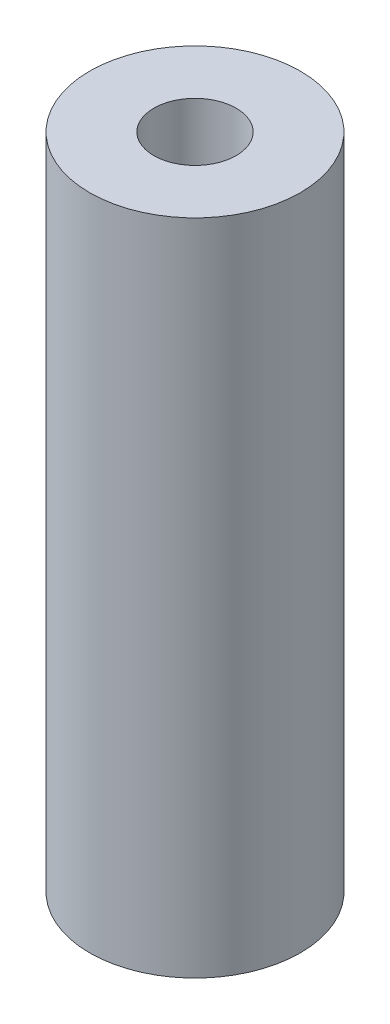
from build123d import *

# Parameters (mm, degrees)
SKETCH1_R      = 4.064
SKETCH1_R_2    = 1.5875
EXTRUDE1_DEPTH = 25.4


with BuildPart() as part:
    # Sketch1 → Extrude1 (new body)
    with BuildSketch(Plane(origin=(0, 0, 0), x_dir=(1, 0, 0), z_dir=(0, 1, 0))):
        with Locations(Location((0, 0, 0), (0, 0, 270))):
            Circle(SKETCH1_R)
        with Locations(Location((0, 0, 0), (0, 0, 270))):
            Circle(SKETCH1_R_2, mode=Mode.SUBTRACT)
    extrude(amount=EXTRUDE1_DEPTH)


solid = part.part
